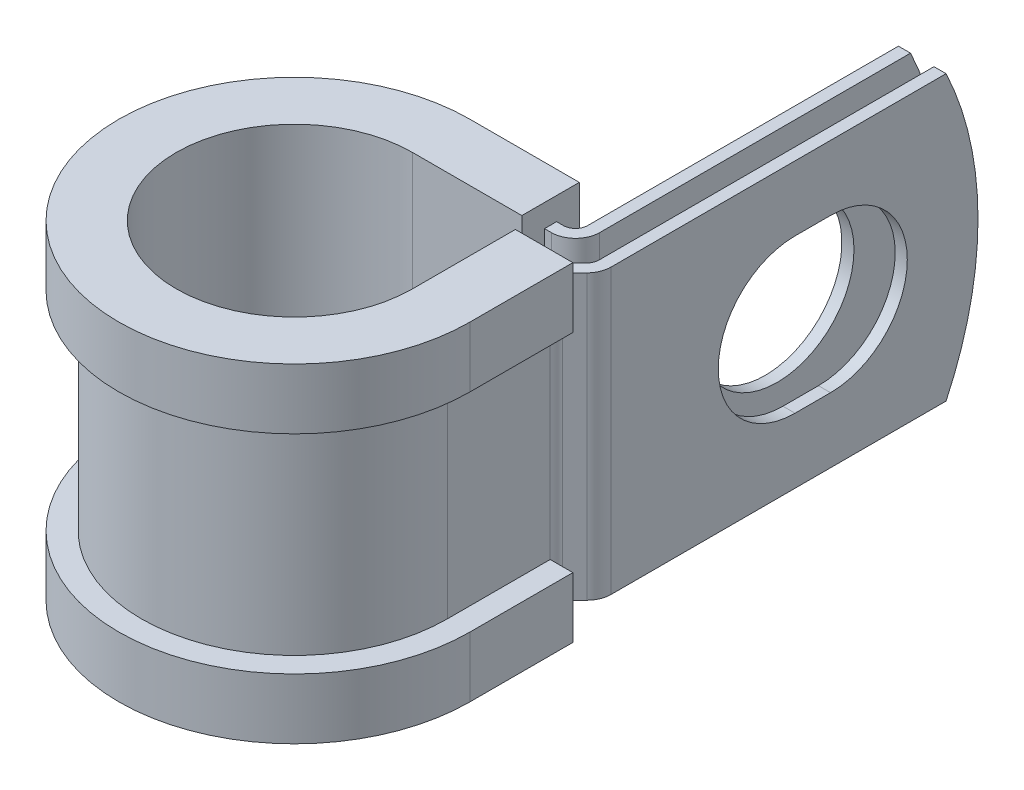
from build123d import *

# Parameters (mm, degrees)
EXTRUDE_THIN1_DEPTH = 9.525
SKETCH2_R           = 5.1562
CUT_EXTRUDE1_DEPTH  = 0.8128
CUT_EXTRUDE2_DEPTH  = 0.8128
CUT_EXTRUDE3_DEPTH  = 41.139083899


with BuildPart() as part:
    # Sketch1 → Extrude-Thin1 (new, symmetric)
    with BuildSketch(Plane(origin=(0, 0, 0), x_dir=(1, 0, 0), z_dir=(0, 1, 0))):
        with BuildLine():
            Line((11.001874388, 34.1122), (11.001874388, 9.4615))
            ThreePointArc((11.001874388, 9.4615), (10.940003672, 9.150454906), (10.76381078, 8.886763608))
            Line((10.76381078, 8.886763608), (9.937627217, 8.060580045))
            ThreePointArc((9.937627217, 8.060580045), (9.585241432, 7.533197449), (9.4615, 6.911107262))
            Line((9.4615, 6.911107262), (9.4615, 0))
            ThreePointArc((9.4615, 0), (-6.69029081, -6.69029081), (0, 9.4615))
            Line((0, 9.4615), (7.801474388, 9.4615))
            ThreePointArc((7.801474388, 9.4615), (8.950947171, 9.937627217), (9.427074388, 11.0871))
            Line((9.427074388, 11.0871), (9.427074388, 34.1122))
            Line((9.427074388, 34.1122), (8.614274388, 34.1122))
            Line((8.614274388, 34.1122), (8.614274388, 11.0871))
            ThreePointArc((8.614274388, 11.0871), (8.37621078, 10.512363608), (7.801474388, 10.2743))
            Line((7.801474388, 10.2743), (0, 10.2743))
            ThreePointArc((0, 10.2743), (-7.265027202, -7.265027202), (10.2743, 0))
            Line((10.2743, 0), (10.2743, 6.911107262))
            ThreePointArc((10.2743, 6.911107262), (10.336170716, 7.222152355), (10.512363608, 7.485843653))
            Line((10.512363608, 7.485843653), (11.338547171, 8.312027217))
            ThreePointArc((11.338547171, 8.312027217), (11.690932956, 8.839409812), (11.814674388, 9.4615))
            Line((11.814674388, 9.4615), (11.814674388, 34.1122))
            Line((11.814674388, 34.1122), (11.001874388, 34.1122))
        make_face()
    extrude(amount=EXTRUDE_THIN1_DEPTH, both=True)

    # Sketch2 → Cut-Extrude1 (cut)
    with BuildSketch(Plane.ZY.offset(-8.614274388)):
        with Locations((-23.0124, 0)):
            Circle(SKETCH2_R)
    extrude(amount=-CUT_EXTRUDE1_DEPTH, mode=Mode.SUBTRACT)

    # Sketch3 → Cut-Extrude2 (cut)
    with BuildSketch(Plane(origin=(11.814674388, 0, 0), x_dir=(0, 0, -1), z_dir=(1, 0, 0))):
        with BuildLine():
            Line((21.8186, 5.1562), (24.2062, 5.1562))
            ThreePointArc((24.2062, 5.1562), (29.3624, 0), (24.2062, -5.1562))
            Line((24.2062, -5.1562), (21.8186, -5.1562))
            ThreePointArc((21.8186, -5.1562), (16.6624, 0), (21.8186, 5.1562))
        make_face()
    extrude(amount=-CUT_EXTRUDE2_DEPTH, mode=Mode.SUBTRACT)

    # Sketch4 → Cut-Extrude3 (cut, through all)
    with BuildSketch(Plane.ZY.offset(-8.614274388)):
        with BuildLine():
            Line((-31.967663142, 9.525), (-34.1122, 9.525))
            Line((-34.1122, 9.525), (-34.1122, 0))
            ThreePointArc((-34.1122, 0), (-33.569438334, 4.881717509), (-31.967663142, 9.525))
        make_face()
        with BuildLine():
            ThreePointArc((-31.967663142, -9.525), (-33.569438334, -4.881717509), (-34.1122, 0))
            Line((-34.1122, 0), (-34.1122, -9.525))
            Line((-34.1122, -9.525), (-31.967663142, -9.525))
        make_face()
    extrude(amount=-CUT_EXTRUDE3_DEPTH, mode=Mode.SUBTRACT)

    # Sweep1: sweep along a path in Sketch6
    with BuildLine(Plane(origin=(0, 9.525, 0), x_dir=(1, 0, 0), z_dir=(0, 1, 0))) as sweep1_path:
        Line((7.9375, 6.911107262), (7.9375, 0))
        ThreePointArc((7.9375, 0), (-5.612660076, -5.612660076), (0, 7.9375))
        Line((0, 7.9375), (7.344274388, 7.9375))
    # Sketch5 → Sweep1 (sweep)
    with BuildSketch(Plane(origin=(0, 0, -6.911107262), x_dir=(-1, 0, 0), z_dir=(0, 0, -1))):
        Polygon((-10.2743, 9.525), (-9.4615, 9.525), (-9.4615, -9.525), (-10.2743, -9.525), (-10.2743, -6.985), (-11.7983, -6.985), (-11.7983, -11.049), (-7.9375, -11.049), (-7.9375, 11.049), (-11.7983, 11.049), (-11.7983, 6.985), (-10.2743, 6.985), align=None)
    sweep(path=sweep1_path.line)


solid = part.part
